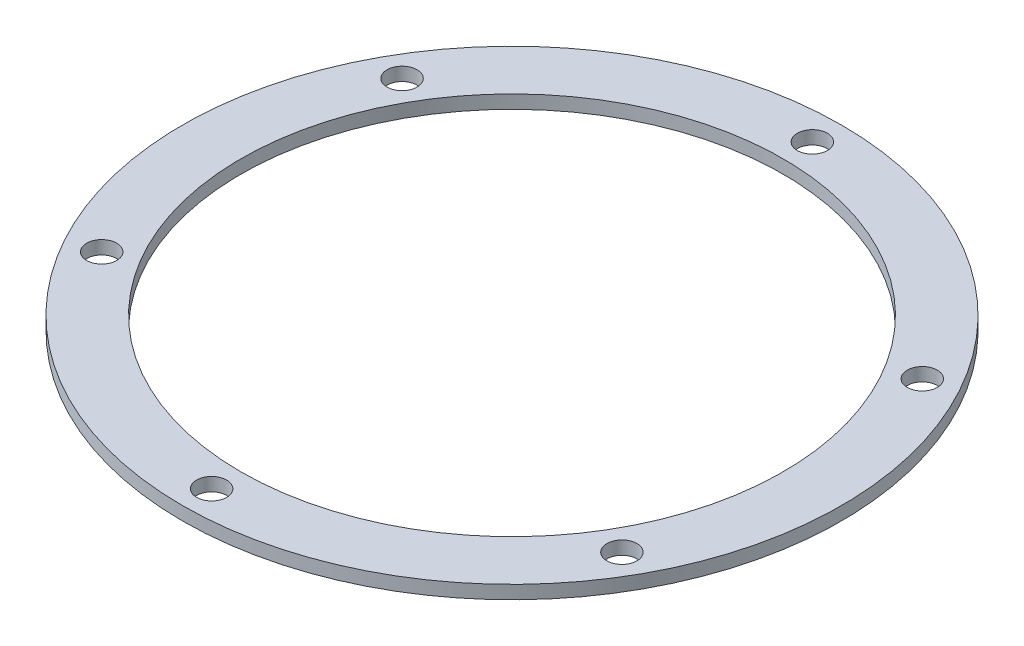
from build123d import *

# Parameters (mm, degrees)
ESQUISSE1_W      = 35
ESQUISSE1_H      = 8
ESQUISSE2_R      = 9
EXTRUSION1_DEPTH = 10


with BuildPart() as part:
    # Esquisse1 → R_volution1 (revolve)
    with BuildSketch(Plane.XY, mode=Mode.PRIVATE) as r_volution1_sk:
        with Locations((-180, -2.994600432)):
            Rectangle(ESQUISSE1_W, ESQUISSE1_H)
    revolve(r_volution1_sk.sketch.rotate(Axis((0, 12.590280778, 0), (0, -1, 0)), 270), axis=Axis((0, 12.590280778, 0), (0, -1, 0)))

    # Esquisse2 → Extrusion1 (cut)
    with BuildSketch(Plane(origin=(0, 1.005399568, 0), x_dir=(1, 0, 0), z_dir=(0, 1, 0))):
        with Locations(Location((0, 180, 0), (0, 0, 270))):
            Circle(ESQUISSE2_R)
        with Locations(Location((155.884572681, 90, 0), (0, 0, 270))):
            Circle(ESQUISSE2_R)
        with Locations(Location((155.884572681, -90, 0), (0, 0, 270))):
            Circle(ESQUISSE2_R)
        with Locations(Location((0, -180, 0), (0, 0, 270))):
            Circle(ESQUISSE2_R)
        with Locations(Location((-155.884572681, -90, 0), (0, 0, 270))):
            Circle(ESQUISSE2_R)
        with Locations(Location((-155.884572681, 90, 0), (0, 0, 270))):
            Circle(ESQUISSE2_R)
    extrude(amount=-EXTRUSION1_DEPTH, mode=Mode.SUBTRACT)


solid = part.part
